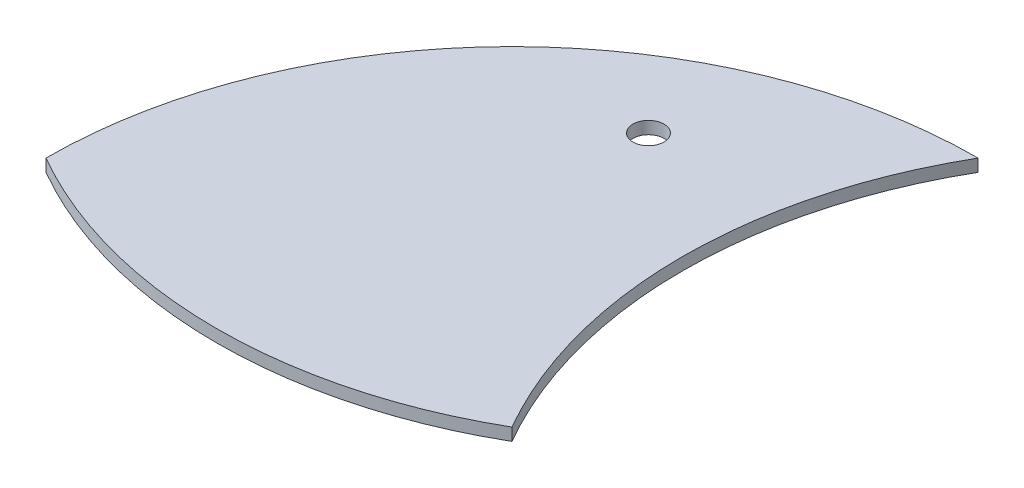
from build123d import *

# Parameters (mm, degrees)
SKETCH1_R           = 1.25
BOSS_EXTRUDE1_DEPTH = 1


with BuildPart() as part:
    # Sketch1 → Boss-Extrude1 (new body)
    with BuildSketch(Plane(origin=(0, 0, 0), x_dir=(1, 0, 0), z_dir=(0, 1, 0))):
        with BuildLine():
            ThreePointArc((0, 0), (-5.024047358, 18.75), (0, 37.5))
            ThreePointArc((0, 37.5), (-26.516504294, 26.516504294), (-37.5, 0))
            ThreePointArc((-37.5, 0), (-18.75, -5.024047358), (0, 0))
        make_face()
        with Locations(Location((-15, 25.980762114, 0), (0, 0, 270))):
            Circle(SKETCH1_R, mode=Mode.SUBTRACT)
    extrude(amount=BOSS_EXTRUDE1_DEPTH)


solid = part.part
